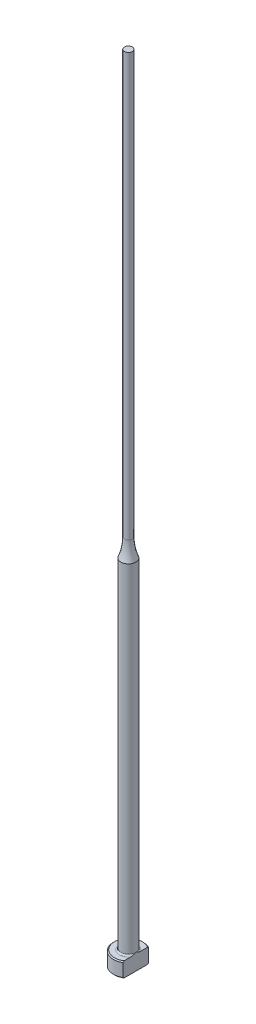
ISO-10303-21;
HEADER;
FILE_DESCRIPTION(('STEP AP214'),'2;1');
FILE_NAME('part.step','',(''),(''),'','','');
FILE_SCHEMA(('AUTOMOTIVE_DESIGN { 1 0 10303 214 1 1 1 1 }'));
ENDSEC;
DATA;
#1=APPLICATION_CONTEXT('core data for automotive mechanical design processes');
#2=APPLICATION_PROTOCOL_DEFINITION('international standard','automotive_design',2000,#1);
#3=PRODUCT_CONTEXT('',#1,'mechanical');
#4=PRODUCT('Part','Part','',(#3));
#5=PRODUCT_RELATED_PRODUCT_CATEGORY('part','',(#4));
#6=PRODUCT_DEFINITION_FORMATION('','',#4);
#7=PRODUCT_DEFINITION_CONTEXT('part definition',#1,'design');
#8=PRODUCT_DEFINITION('design','',#6,#7);
#9=PRODUCT_DEFINITION_SHAPE('','',#8);
#10=(LENGTH_UNIT() NAMED_UNIT(*) SI_UNIT(.MILLI.,.METRE.));
#11=(NAMED_UNIT(*) PLANE_ANGLE_UNIT() SI_UNIT($,.RADIAN.));
#12=(NAMED_UNIT(*) SI_UNIT($,.STERADIAN.) SOLID_ANGLE_UNIT());
#13=UNCERTAINTY_MEASURE_WITH_UNIT(LENGTH_MEASURE(1.E-05),#10,'distance_accuracy_value','');
#14=(GEOMETRIC_REPRESENTATION_CONTEXT(3) GLOBAL_UNCERTAINTY_ASSIGNED_CONTEXT((#13)) GLOBAL_UNIT_ASSIGNED_CONTEXT((#10,
#11,#12)) REPRESENTATION_CONTEXT('',''));
#15=CARTESIAN_POINT('',(0.,0.,0.));
#16=DIRECTION('',(0.,0.,1.));
#17=DIRECTION('',(1.,0.,0.));
#18=AXIS2_PLACEMENT_3D('',#15,#16,#17);
#19=CARTESIAN_POINT('',(-2.99999999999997,3.,0.));
#20=DIRECTION('',(0.,1.,0.));
#21=DIRECTION('',(0.,0.,1.));
#22=AXIS2_PLACEMENT_3D('',#19,#20,#21);
#23=PLANE('',#22);
#24=CARTESIAN_POINT('',(0.,3.,0.));
#25=DIRECTION('',(0.,1.,0.));
#26=DIRECTION('',(0.,0.,1.));
#27=AXIS2_PLACEMENT_3D('',#24,#25,#26);
#28=CIRCLE('',#27,2.79999999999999);
#29=CARTESIAN_POINT('',(1.49999999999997,3.,-2.36431808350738));
#30=VERTEX_POINT('',#29);
#31=CARTESIAN_POINT('',(1.49999999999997,3.,2.36431808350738));
#32=VERTEX_POINT('',#31);
#33=EDGE_CURVE('E187',#30,#32,#28,.T.);
#34=ORIENTED_EDGE('',*,*,#33,.T.);
#35=DIRECTION('',(0.,0.,-1.));
#36=VECTOR('',#35,1.);
#37=CARTESIAN_POINT('',(1.49999999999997,3.,0.));
#38=LINE('',#37,#36);
#39=CARTESIAN_POINT('',(1.49999999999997,3.00000000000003,0.99498743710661));
#40=VERTEX_POINT('',#39);
#41=EDGE_CURVE('E57',#32,#40,#38,.T.);
#42=ORIENTED_EDGE('',*,*,#41,.T.);
#43=CARTESIAN_POINT('',(0.,3.,0.));
#44=DIRECTION('',(0.,1.,0.));
#45=DIRECTION('',(0.,0.,1.));
#46=AXIS2_PLACEMENT_3D('',#43,#44,#45);
#47=CIRCLE('',#46,1.79999999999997);
#48=CARTESIAN_POINT('',(1.49999999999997,3.00000000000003,-0.994987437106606));
#49=VERTEX_POINT('',#48);
#50=EDGE_CURVE('E108',#40,#49,#47,.F.);
#51=ORIENTED_EDGE('',*,*,#50,.T.);
#52=EDGE_CURVE('E137',#49,#30,#38,.T.);
#53=ORIENTED_EDGE('',*,*,#52,.T.);
#54=EDGE_LOOP('',(#34,#42,#51,#53));
#55=FACE_BOUND('',#54,.T.);
#56=ADVANCED_FACE('F32',(#55),#23,.T.);
#57=CARTESIAN_POINT('',(0.,259.958771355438,0.));
#58=DIRECTION('',(0.,1.,0.));
#59=DIRECTION('',(0.,0.,1.));
#60=AXIS2_PLACEMENT_3D('',#57,#58,#59);
#61=CYLINDRICAL_SURFACE('',#60,2.99999999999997);
#62=CARTESIAN_POINT('',(0.,2.80000000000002,0.));
#63=DIRECTION('',(0.,1.,0.));
#64=DIRECTION('',(0.,0.,1.));
#65=AXIS2_PLACEMENT_3D('',#62,#63,#64);
#66=CIRCLE('',#65,2.99999999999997);
#67=CARTESIAN_POINT('',(1.49999999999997,2.80000000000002,2.5980762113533));
#68=VERTEX_POINT('',#67);
#69=CARTESIAN_POINT('',(1.49999999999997,2.80000000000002,-2.5980762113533));
#70=VERTEX_POINT('',#69);
#71=EDGE_CURVE('E105',#68,#70,#66,.F.);
#72=ORIENTED_EDGE('',*,*,#71,.T.);
#73=DIRECTION('',(0.,-1.,0.));
#74=VECTOR('',#73,1.);
#75=CARTESIAN_POINT('',(1.49999999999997,160.,-2.5980762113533));
#76=LINE('',#75,#74);
#77=CARTESIAN_POINT('',(1.49999999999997,0.200000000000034,-2.5980762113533));
#78=VERTEX_POINT('',#77);
#79=EDGE_CURVE('E193',#70,#78,#76,.T.);
#80=ORIENTED_EDGE('',*,*,#79,.T.);
#81=CARTESIAN_POINT('',(0.,0.200000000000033,0.));
#82=DIRECTION('',(0.,-1.,0.));
#83=DIRECTION('',(0.,0.,-1.));
#84=AXIS2_PLACEMENT_3D('',#81,#82,#83);
#85=CIRCLE('',#84,2.99999999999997);
#86=CARTESIAN_POINT('',(1.49999999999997,0.200000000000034,2.5980762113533));
#87=VERTEX_POINT('',#86);
#88=EDGE_CURVE('E100',#78,#87,#85,.F.);
#89=ORIENTED_EDGE('',*,*,#88,.T.);
#90=DIRECTION('',(0.,-1.,0.));
#91=VECTOR('',#90,1.);
#92=CARTESIAN_POINT('',(1.49999999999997,160.,2.5980762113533));
#93=LINE('',#92,#91);
#94=EDGE_CURVE('E93',#68,#87,#93,.T.);
#95=ORIENTED_EDGE('',*,*,#94,.F.);
#96=EDGE_LOOP('',(#72,#80,#89,#95));
#97=FACE_BOUND('',#96,.T.);
#98=ADVANCED_FACE('F158',(#97),#61,.T.);
#99=CARTESIAN_POINT('',(0.,0.,0.));
#100=DIRECTION('',(0.,-1.,0.));
#101=DIRECTION('',(0.,0.,-1.));
#102=AXIS2_PLACEMENT_3D('',#99,#100,#101);
#103=PLANE('',#102);
#104=CARTESIAN_POINT('',(0.,0.,0.));
#105=DIRECTION('',(0.,-1.,0.));
#106=DIRECTION('',(0.,0.,-1.));
#107=AXIS2_PLACEMENT_3D('',#104,#105,#106);
#108=CIRCLE('',#107,2.79999999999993);
#109=CARTESIAN_POINT('',(1.49999999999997,0.,2.36431808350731));
#110=VERTEX_POINT('',#109);
#111=CARTESIAN_POINT('',(1.49999999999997,0.,-2.36431808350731));
#112=VERTEX_POINT('',#111);
#113=EDGE_CURVE('E98',#110,#112,#108,.T.);
#114=ORIENTED_EDGE('',*,*,#113,.T.);
#115=DIRECTION('',(0.,0.,1.));
#116=VECTOR('',#115,1.);
#117=CARTESIAN_POINT('',(1.49999999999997,0.,-2.5980762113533));
#118=LINE('',#117,#116);
#119=EDGE_CURVE('E83',#112,#110,#118,.T.);
#120=ORIENTED_EDGE('',*,*,#119,.T.);
#121=EDGE_LOOP('',(#114,#120));
#122=FACE_BOUND('',#121,.T.);
#123=ADVANCED_FACE('F103',(#122),#103,.T.);
#124=CARTESIAN_POINT('',(0.,3.,0.));
#125=DIRECTION('',(0.,-1.,0.));
#126=DIRECTION('',(0.,0.,-1.));
#127=AXIS2_PLACEMENT_3D('',#124,#125,#126);
#128=CONICAL_SURFACE('',#127,2.79999999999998,0.785398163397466);
#129=ORIENTED_EDGE('',*,*,#71,.F.);
#130=CARTESIAN_POINT('',(1.49999999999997,-0.111741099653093,5.71827621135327));
#131=CARTESIAN_POINT('',(1.49999999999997,0.0136183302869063,5.58866816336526));
#132=CARTESIAN_POINT('',(1.49999999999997,0.138843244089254,5.45892957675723));
#133=CARTESIAN_POINT('',(1.49999999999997,0.388944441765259,5.19911365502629));
#134=CARTESIAN_POINT('',(1.49999999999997,0.513820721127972,5.06903631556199));
#135=CARTESIAN_POINT('',(1.49999999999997,0.763205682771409,4.80840180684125));
#136=CARTESIAN_POINT('',(1.49999999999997,0.887714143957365,4.67784442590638));
#137=CARTESIAN_POINT('',(1.49999999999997,1.13618059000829,4.41620813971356));
#138=CARTESIAN_POINT('',(1.49999999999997,1.26013857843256,4.28512923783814));
#139=CARTESIAN_POINT('',(1.49999999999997,1.50488975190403,4.02490837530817));
#140=CARTESIAN_POINT('',(1.49999999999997,1.6256969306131,3.89577958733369));
#141=CARTESIAN_POINT('',(1.49999999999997,1.86640694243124,3.63668213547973));
#142=CARTESIAN_POINT('',(1.49999999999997,1.98630978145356,3.50671347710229));
#143=CARTESIAN_POINT('',(1.49999999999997,2.22486033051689,3.24567921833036));
#144=CARTESIAN_POINT('',(1.49999999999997,2.34350830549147,3.11461386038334));
#145=CARTESIAN_POINT('',(1.49999999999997,2.57907716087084,2.85094268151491));
#146=CARTESIAN_POINT('',(1.49999999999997,2.69599811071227,2.71833692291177));
#147=CARTESIAN_POINT('',(1.49999999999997,2.88262371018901,2.50255231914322));
#148=CARTESIAN_POINT('',(1.49999999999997,2.95312454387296,2.42006293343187));
#149=CARTESIAN_POINT('',(1.49999999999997,3.0928709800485,2.25401084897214));
#150=CARTESIAN_POINT('',(1.49999999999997,3.16211645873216,2.17044804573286));
#151=CARTESIAN_POINT('',(1.49999999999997,3.29964684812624,2.00105967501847));
#152=CARTESIAN_POINT('',(1.49999999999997,3.36791386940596,1.91521952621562));
#153=CARTESIAN_POINT('',(1.49999999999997,3.50205840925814,1.74171392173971));
#154=CARTESIAN_POINT('',(1.49999999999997,3.56793649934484,1.65404891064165));
#155=CARTESIAN_POINT('',(1.49999999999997,3.69728151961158,1.47490236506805));
#156=CARTESIAN_POINT('',(1.49999999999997,3.76069661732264,1.38338308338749));
#157=CARTESIAN_POINT('',(1.49999999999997,3.8823953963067,1.19675661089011));
#158=CARTESIAN_POINT('',(1.49999999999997,3.94067201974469,1.10164473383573));
#159=CARTESIAN_POINT('',(1.49999999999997,4.04841325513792,0.908008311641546));
#160=CARTESIAN_POINT('',(1.49999999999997,4.0979780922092,0.809540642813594));
#161=CARTESIAN_POINT('',(1.49999999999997,4.18432188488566,0.607192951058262));
#162=CARTESIAN_POINT('',(1.49999999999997,4.22114374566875,0.503332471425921));
#163=CARTESIAN_POINT('',(1.49999999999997,4.26099935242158,0.347577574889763));
#164=CARTESIAN_POINT('',(1.49999999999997,4.27157029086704,0.297609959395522));
#165=CARTESIAN_POINT('',(1.49999999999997,4.28794860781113,0.196885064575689));
#166=CARTESIAN_POINT('',(1.49999999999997,4.29375640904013,0.146127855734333));
#167=CARTESIAN_POINT('',(1.49999999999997,4.30019707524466,0.0444388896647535));
#168=CARTESIAN_POINT('',(1.49999999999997,4.30084594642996,-0.00649183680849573));
#169=CARTESIAN_POINT('',(1.49999999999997,4.29696416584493,-0.108155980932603));
#170=CARTESIAN_POINT('',(1.49999999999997,4.29243308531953,-0.15888938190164));
#171=CARTESIAN_POINT('',(1.49999999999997,4.27856915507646,-0.259234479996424));
#172=CARTESIAN_POINT('',(1.49999999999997,4.26927821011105,-0.30885208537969));
#173=CARTESIAN_POINT('',(1.49999999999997,4.24647108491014,-0.407110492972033));
#174=CARTESIAN_POINT('',(1.49999999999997,4.2329532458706,-0.455750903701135));
#175=CARTESIAN_POINT('',(1.49999999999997,4.20226175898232,-0.552149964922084));
#176=CARTESIAN_POINT('',(1.49999999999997,4.18506801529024,-0.599902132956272));
#177=CARTESIAN_POINT('',(1.49999999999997,4.14771387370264,-0.694205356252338));
#178=CARTESIAN_POINT('',(1.49999999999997,4.1275540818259,-0.740756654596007));
#179=CARTESIAN_POINT('',(1.49999999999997,4.06327696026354,-0.879166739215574));
#180=CARTESIAN_POINT('',(1.49999999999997,4.01551721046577,-0.969329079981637));
#181=CARTESIAN_POINT('',(1.49999999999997,3.91367909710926,-1.1460431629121));
#182=CARTESIAN_POINT('',(1.49999999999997,3.85959300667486,-1.23259031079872));
#183=CARTESIAN_POINT('',(1.49999999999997,3.74697968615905,-1.40321348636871));
#184=CARTESIAN_POINT('',(1.49999999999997,3.68843573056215,-1.48727838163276));
#185=CARTESIAN_POINT('',(1.49999999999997,3.56843845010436,-1.65322187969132));
#186=CARTESIAN_POINT('',(1.49999999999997,3.50698656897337,-1.73510153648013));
#187=CARTESIAN_POINT('',(1.49999999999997,3.38115673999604,-1.89829823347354));
#188=CARTESIAN_POINT('',(1.49999999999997,3.31675092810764,-1.97959369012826));
#189=CARTESIAN_POINT('',(1.49999999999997,3.18634068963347,-2.14090082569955));
#190=CARTESIAN_POINT('',(1.49999999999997,3.12033609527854,-2.22091236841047));
#191=CARTESIAN_POINT('',(1.49999999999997,2.92086431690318,-2.45906508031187));
#192=CARTESIAN_POINT('',(1.49999999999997,2.78562663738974,-2.61572090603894));
#193=CARTESIAN_POINT('',(1.49999999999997,2.53554498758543,-2.90006295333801));
#194=CARTESIAN_POINT('',(1.49999999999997,2.42114543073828,-3.02814382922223));
#195=CARTESIAN_POINT('',(1.49999999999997,2.19093557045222,-3.28303767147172));
#196=CARTESIAN_POINT('',(1.49999999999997,2.07512522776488,-3.40985060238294));
#197=CARTESIAN_POINT('',(1.49999999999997,1.72597067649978,-3.7891384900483));
#198=CARTESIAN_POINT('',(1.49999999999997,1.49111760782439,-4.04022177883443));
#199=CARTESIAN_POINT('',(1.49999999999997,1.02882478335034,-4.52992803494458));
#200=CARTESIAN_POINT('',(1.49999999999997,0.801477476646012,-4.76863870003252));
#201=CARTESIAN_POINT('',(1.49999999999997,0.459548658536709,-5.12558036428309));
#202=CARTESIAN_POINT('',(1.49999999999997,0.345484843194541,-5.2443077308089));
#203=CARTESIAN_POINT('',(1.49999999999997,0.117071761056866,-5.48148573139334));
#204=CARTESIAN_POINT('',(1.49999999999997,0.00272249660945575,-5.59993636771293));
#205=CARTESIAN_POINT('',(1.49999999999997,-0.111741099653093,-5.71827621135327));
#206=B_SPLINE_CURVE_WITH_KNOTS('',3,(#130,#131,#132,#133,#134,#135,#136,#137,#138,#139,#140,
#141,#142,#143,#144,#145,#146,#147,#148,#149,#150,#151,#152,#153,#154,#155,#156,#157,#158,#159,
#160,#161,#162,#163,#164,#165,#166,#167,#168,#169,#170,#171,#172,#173,#174,#175,#176,#177,#178,
#179,#180,#181,#182,#183,#184,#185,#186,#187,#188,#189,#190,#191,#192,#193,#194,#195,#196,#197,
#198,#199,#200,#201,#202,#203,#204,#205),.UNSPECIFIED.,.F.,.F.,(4,2,2,2,2,2,2,2,2,2,2,2,2,2,2,2,
2,2,2,2,2,2,2,2,2,2,2,2,2,2,2,2,2,2,2,2,2,4),(0.,0.540943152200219,1.08189327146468,
1.62312052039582,2.16434426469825,2.69482920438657,3.22531067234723,3.75567781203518,
4.2860235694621,4.61155053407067,4.93710943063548,5.2661094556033,5.59503024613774,
5.92894782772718,6.26331713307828,6.59354403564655,6.92264800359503,7.0756747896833,
7.22868799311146,7.38122626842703,7.53377717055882,7.68500755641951,7.83629736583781,
7.98843643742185,8.14054446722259,8.44618799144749,8.75220879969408,9.05944044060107,
9.36652111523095,9.67764287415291,9.98879742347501,10.6095925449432,11.1247803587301,
11.6399825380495,12.6713544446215,13.6603005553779,14.1542238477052,14.6481430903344),.UNSPECIFIED.);
#207=EDGE_CURVE('E136',#68,#32,#206,.T.);
#208=ORIENTED_EDGE('',*,*,#207,.T.);
#209=ORIENTED_EDGE('',*,*,#33,.F.);
#210=EDGE_CURVE('E128',#30,#70,#206,.T.);
#211=ORIENTED_EDGE('',*,*,#210,.T.);
#212=EDGE_LOOP('',(#129,#208,#209,#211));
#213=FACE_BOUND('',#212,.T.);
#214=ADVANCED_FACE('F144',(#213),#128,.T.);
#215=CARTESIAN_POINT('',(0.,0.200000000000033,0.));
#216=DIRECTION('',(0.,1.,0.));
#217=DIRECTION('',(0.,0.,1.));
#218=AXIS2_PLACEMENT_3D('',#215,#216,#217);
#219=CONICAL_SURFACE('',#218,2.99999999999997,0.785398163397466);
#220=ORIENTED_EDGE('',*,*,#88,.F.);
#221=CARTESIAN_POINT('',(1.49999999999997,3.11174109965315,-5.71827621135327));
#222=CARTESIAN_POINT('',(1.49999999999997,2.98638166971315,-5.58866816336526));
#223=CARTESIAN_POINT('',(1.49999999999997,2.8611567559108,-5.45892957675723));
#224=CARTESIAN_POINT('',(1.49999999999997,2.6110555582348,-5.19911365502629));
#225=CARTESIAN_POINT('',(1.49999999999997,2.48617927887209,-5.06903631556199));
#226=CARTESIAN_POINT('',(1.49999999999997,2.23679431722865,-4.80840180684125));
#227=CARTESIAN_POINT('',(1.49999999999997,2.11228585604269,-4.67784442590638));
#228=CARTESIAN_POINT('',(1.49999999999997,1.86381940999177,-4.41620813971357));
#229=CARTESIAN_POINT('',(1.49999999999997,1.7398614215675,-4.28512923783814));
#230=CARTESIAN_POINT('',(1.49999999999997,1.49511024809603,-4.02490837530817));
#231=CARTESIAN_POINT('',(1.49999999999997,1.37430306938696,-3.89577958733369));
#232=CARTESIAN_POINT('',(1.49999999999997,1.13359305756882,-3.63668213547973));
#233=CARTESIAN_POINT('',(1.49999999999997,1.0136902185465,-3.50671347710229));
#234=CARTESIAN_POINT('',(1.49999999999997,0.775139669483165,-3.24567921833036));
#235=CARTESIAN_POINT('',(1.49999999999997,0.656491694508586,-3.11461386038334));
#236=CARTESIAN_POINT('',(1.49999999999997,0.420922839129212,-2.85094268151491));
#237=CARTESIAN_POINT('',(1.49999999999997,0.304001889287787,-2.71833692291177));
#238=CARTESIAN_POINT('',(1.49999999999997,0.117376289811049,-2.50255231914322));
#239=CARTESIAN_POINT('',(1.49999999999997,0.0468754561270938,-2.42006293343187));
#240=CARTESIAN_POINT('',(1.49999999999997,-0.0928709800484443,-2.25401084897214));
#241=CARTESIAN_POINT('',(1.49999999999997,-0.162116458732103,-2.17044804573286));
#242=CARTESIAN_POINT('',(1.49999999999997,-0.299646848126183,-2.00105967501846));
#243=CARTESIAN_POINT('',(1.49999999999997,-0.367913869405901,-1.91521952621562));
#244=CARTESIAN_POINT('',(1.49999999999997,-0.502058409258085,-1.74171392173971));
#245=CARTESIAN_POINT('',(1.49999999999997,-0.567936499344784,-1.65404891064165));
#246=CARTESIAN_POINT('',(1.49999999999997,-0.697281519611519,-1.47490236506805));
#247=CARTESIAN_POINT('',(1.49999999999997,-0.760696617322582,-1.38338308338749));
#248=CARTESIAN_POINT('',(1.49999999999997,-0.882395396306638,-1.19675661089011));
#249=CARTESIAN_POINT('',(1.49999999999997,-0.940672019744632,-1.10164473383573));
#250=CARTESIAN_POINT('',(1.49999999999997,-1.04841325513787,-0.908008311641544));
#251=CARTESIAN_POINT('',(1.49999999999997,-1.09797809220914,-0.809540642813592));
#252=CARTESIAN_POINT('',(1.49999999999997,-1.1843218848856,-0.60719295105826));
#253=CARTESIAN_POINT('',(1.49999999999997,-1.22114374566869,-0.503332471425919));
#254=CARTESIAN_POINT('',(1.49999999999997,-1.26099935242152,-0.347577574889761));
#255=CARTESIAN_POINT('',(1.49999999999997,-1.27157029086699,-0.29760995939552));
#256=CARTESIAN_POINT('',(1.49999999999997,-1.28794860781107,-0.196885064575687));
#257=CARTESIAN_POINT('',(1.49999999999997,-1.29375640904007,-0.146127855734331));
#258=CARTESIAN_POINT('',(1.49999999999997,-1.30019707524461,-0.0444388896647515));
#259=CARTESIAN_POINT('',(1.49999999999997,-1.3008459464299,0.00649183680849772));
#260=CARTESIAN_POINT('',(1.49999999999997,-1.29696416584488,0.108155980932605));
#261=CARTESIAN_POINT('',(1.49999999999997,-1.29243308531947,0.158889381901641));
#262=CARTESIAN_POINT('',(1.49999999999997,-1.2785691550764,0.259234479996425));
#263=CARTESIAN_POINT('',(1.49999999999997,-1.26927821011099,0.308852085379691));
#264=CARTESIAN_POINT('',(1.49999999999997,-1.24647108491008,0.407110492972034));
#265=CARTESIAN_POINT('',(1.49999999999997,-1.23295324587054,0.455750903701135));
#266=CARTESIAN_POINT('',(1.49999999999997,-1.20226175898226,0.552149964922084));
#267=CARTESIAN_POINT('',(1.49999999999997,-1.18506801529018,0.599902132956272));
#268=CARTESIAN_POINT('',(1.49999999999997,-1.14771387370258,0.694205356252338));
#269=CARTESIAN_POINT('',(1.49999999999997,-1.12755408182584,0.740756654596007));
#270=CARTESIAN_POINT('',(1.49999999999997,-1.06327696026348,0.879166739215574));
#271=CARTESIAN_POINT('',(1.49999999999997,-1.01551721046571,0.969329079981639));
#272=CARTESIAN_POINT('',(1.49999999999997,-0.913679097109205,1.1460431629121));
#273=CARTESIAN_POINT('',(1.49999999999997,-0.8595930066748,1.23259031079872));
#274=CARTESIAN_POINT('',(1.49999999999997,-0.746979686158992,1.40321348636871));
#275=CARTESIAN_POINT('',(1.49999999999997,-0.688435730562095,1.48727838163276));
#276=CARTESIAN_POINT('',(1.49999999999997,-0.568438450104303,1.65322187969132));
#277=CARTESIAN_POINT('',(1.49999999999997,-0.506986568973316,1.73510153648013));
#278=CARTESIAN_POINT('',(1.49999999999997,-0.381156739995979,1.89829823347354));
#279=CARTESIAN_POINT('',(1.49999999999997,-0.316750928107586,1.97959369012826));
#280=CARTESIAN_POINT('',(1.49999999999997,-0.186340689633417,2.14090082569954));
#281=CARTESIAN_POINT('',(1.49999999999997,-0.120336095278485,2.22091236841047));
#282=CARTESIAN_POINT('',(1.49999999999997,0.0791356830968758,2.45906508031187));
#283=CARTESIAN_POINT('',(1.49999999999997,0.214373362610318,2.61572090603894));
#284=CARTESIAN_POINT('',(1.49999999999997,0.46445501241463,2.90006295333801));
#285=CARTESIAN_POINT('',(1.49999999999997,0.578854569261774,3.02814382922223));
#286=CARTESIAN_POINT('',(1.49999999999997,0.809064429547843,3.28303767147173));
#287=CARTESIAN_POINT('',(1.49999999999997,0.924874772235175,3.40985060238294));
#288=CARTESIAN_POINT('',(1.49999999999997,1.27402932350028,3.78913849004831));
#289=CARTESIAN_POINT('',(1.49999999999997,1.50888239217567,4.04022177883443));
#290=CARTESIAN_POINT('',(1.49999999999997,1.97117521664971,4.52992803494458));
#291=CARTESIAN_POINT('',(1.49999999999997,2.19852252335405,4.76863870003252));
#292=CARTESIAN_POINT('',(1.49999999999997,2.54045134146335,5.12558036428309));
#293=CARTESIAN_POINT('',(1.49999999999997,2.65451515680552,5.2443077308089));
#294=CARTESIAN_POINT('',(1.49999999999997,2.88292823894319,5.48148573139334));
#295=CARTESIAN_POINT('',(1.49999999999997,2.9972775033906,5.59993636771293));
#296=CARTESIAN_POINT('',(1.49999999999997,3.11174109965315,5.71827621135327));
#297=B_SPLINE_CURVE_WITH_KNOTS('',3,(#221,#222,#223,#224,#225,#226,#227,#228,#229,#230,#231,
#232,#233,#234,#235,#236,#237,#238,#239,#240,#241,#242,#243,#244,#245,#246,#247,#248,#249,#250,
#251,#252,#253,#254,#255,#256,#257,#258,#259,#260,#261,#262,#263,#264,#265,#266,#267,#268,#269,
#270,#271,#272,#273,#274,#275,#276,#277,#278,#279,#280,#281,#282,#283,#284,#285,#286,#287,#288,
#289,#290,#291,#292,#293,#294,#295,#296),.UNSPECIFIED.,.F.,.F.,(4,2,2,2,2,2,2,2,2,2,2,2,2,2,2,2,
2,2,2,2,2,2,2,2,2,2,2,2,2,2,2,2,2,2,2,2,2,4),(0.,0.540943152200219,1.08189327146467,
1.62312052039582,2.16434426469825,2.69482920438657,3.22531067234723,3.75567781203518,
4.28602356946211,4.61155053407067,4.93710943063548,5.2661094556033,5.59503024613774,
5.92894782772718,6.26331713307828,6.59354403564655,6.92264800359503,7.0756747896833,
7.22868799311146,7.38122626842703,7.53377717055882,7.68500755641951,7.83629736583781,
7.98843643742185,8.14054446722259,8.4461879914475,8.75220879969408,9.05944044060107,
9.36652111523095,9.6776428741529,9.98879742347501,10.6095925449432,11.1247803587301,
11.6399825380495,12.6713544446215,13.6603005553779,14.1542238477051,14.6481430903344),.UNSPECIFIED.);
#298=EDGE_CURVE('E86',#78,#112,#297,.T.);
#299=ORIENTED_EDGE('',*,*,#298,.T.);
#300=ORIENTED_EDGE('',*,*,#113,.F.);
#301=EDGE_CURVE('E89',#110,#87,#297,.T.);
#302=ORIENTED_EDGE('',*,*,#301,.T.);
#303=EDGE_LOOP('',(#220,#299,#300,#302));
#304=FACE_BOUND('',#303,.T.);
#305=ADVANCED_FACE('F97',(#304),#219,.T.);
#306=CARTESIAN_POINT('',(0.,3.30000000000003,0.));
#307=DIRECTION('',(0.,1.,0.));
#308=DIRECTION('',(0.,0.,1.));
#309=AXIS2_PLACEMENT_3D('',#306,#307,#308);
#310=TOROIDAL_SURFACE('',#309,1.79999999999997,0.3);
#311=CARTESIAN_POINT('',(1.49999999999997,3.30000000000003,0.));
#312=CARTESIAN_POINT('',(1.49999999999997,3.300000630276,3.41555678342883E-12));
#313=CARTESIAN_POINT('',(1.49999999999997,3.30000126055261,-1.15373640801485E-07));
#314=CARTESIAN_POINT('',(1.49999999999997,3.3000024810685,-4.90631575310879E-07));
#315=CARTESIAN_POINT('',(1.49999999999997,3.30000307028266,-7.53296670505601E-07));
#316=CARTESIAN_POINT('',(1.49999999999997,3.30000424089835,-1.38757096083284E-06));
#317=CARTESIAN_POINT('',(1.49999999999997,3.300004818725,-1.76563001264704E-06));
#318=CARTESIAN_POINT('',(1.49999999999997,3.30000591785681,-2.58768006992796E-06));
#319=CARTESIAN_POINT('',(1.49999999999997,3.30000643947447,-3.03127014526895E-06));
#320=CARTESIAN_POINT('',(1.49999999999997,3.30000815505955,-4.60021967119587E-06));
#321=CARTESIAN_POINT('',(1.49999999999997,3.30000927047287,-5.8124152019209E-06));
#322=CARTESIAN_POINT('',(1.49999999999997,3.30001128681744,-8.33989413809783E-06));
#323=CARTESIAN_POINT('',(1.49999999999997,3.30001219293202,-9.65128157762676E-06));
#324=CARTESIAN_POINT('',(1.49999999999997,3.30001551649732,-1.46782505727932E-05));
#325=CARTESIAN_POINT('',(1.49999999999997,3.30001775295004,-1.8517976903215E-05));
#326=CARTESIAN_POINT('',(1.49999999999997,3.30002148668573,-2.61616194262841E-05));
#327=CARTESIAN_POINT('',(1.49999999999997,3.30002302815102,-2.99447742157E-05));
#328=CARTESIAN_POINT('',(1.49999999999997,3.30002943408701,-4.58003743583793E-05));
#329=CARTESIAN_POINT('',(1.49999999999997,3.3000341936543,-5.79079078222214E-05));
#330=CARTESIAN_POINT('',(1.49999999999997,3.30004197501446,-8.07263755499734E-05));
#331=CARTESIAN_POINT('',(1.49999999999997,3.30004514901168,-9.13834709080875E-05));
#332=CARTESIAN_POINT('',(1.49999999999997,3.30006989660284,-0.000167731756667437));
#333=CARTESIAN_POINT('',(1.49999999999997,3.30010092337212,-0.000229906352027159));
#334=CARTESIAN_POINT('',(1.49999999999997,3.30021632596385,-0.000470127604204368));
#335=CARTESIAN_POINT('',(1.49999999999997,3.30029368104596,-0.000650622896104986));
#336=CARTESIAN_POINT('',(1.49999999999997,3.30059619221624,-0.00134589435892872));
#337=CARTESIAN_POINT('',(1.49999999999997,3.30082870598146,-0.00185814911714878));
#338=CARTESIAN_POINT('',(1.49999999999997,3.30176696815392,-0.00393547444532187));
#339=CARTESIAN_POINT('',(1.49999999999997,3.30246445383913,-0.00550332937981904));
#340=CARTESIAN_POINT('',(1.49999999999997,3.31426785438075,-0.0320229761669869));
#341=CARTESIAN_POINT('',(1.49999999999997,3.32544800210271,-0.0569503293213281));
#342=CARTESIAN_POINT('',(1.49999999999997,3.34725700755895,-0.105984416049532));
#343=CARTESIAN_POINT('',(1.49999999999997,3.35789134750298,-0.130088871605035));
#344=CARTESIAN_POINT('',(1.49999999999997,3.38015321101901,-0.181096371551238));
#345=CARTESIAN_POINT('',(1.49999999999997,3.39175804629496,-0.208009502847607));
#346=CARTESIAN_POINT('',(1.49999999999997,3.41469034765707,-0.262264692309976));
#347=CARTESIAN_POINT('',(1.49999999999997,3.42601398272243,-0.289608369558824));
#348=CARTESIAN_POINT('',(1.49999999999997,3.45363212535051,-0.35820378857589));
#349=CARTESIAN_POINT('',(1.49999999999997,3.46959026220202,-0.39959288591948));
#350=CARTESIAN_POINT('',(1.49999999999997,3.49940505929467,-0.482097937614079));
#351=CARTESIAN_POINT('',(1.49999999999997,3.51330033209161,-0.523199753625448));
#352=CARTESIAN_POINT('',(1.49999999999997,3.53552507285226,-0.595497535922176));
#353=CARTESIAN_POINT('',(1.49999999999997,3.54436834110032,-0.626532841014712));
#354=CARTESIAN_POINT('',(1.49999999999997,3.56052427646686,-0.6891760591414));
#355=CARTESIAN_POINT('',(1.49999999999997,3.5678279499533,-0.720786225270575));
#356=CARTESIAN_POINT('',(1.49999999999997,3.5875075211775,-0.819524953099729));
#357=CARTESIAN_POINT('',(1.49999999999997,3.59661044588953,-0.88742909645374));
#358=CARTESIAN_POINT('',(1.49999999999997,3.60059842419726,-0.991180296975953));
#359=CARTESIAN_POINT('',(1.49999999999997,3.60019840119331,-1.02684364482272));
#360=CARTESIAN_POINT('',(1.49999999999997,3.59497085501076,-1.097505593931));
#361=CARTESIAN_POINT('',(1.49999999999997,3.59019295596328,-1.13250716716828));
#362=CARTESIAN_POINT('',(1.49999999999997,3.57687734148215,-1.19353096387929));
#363=CARTESIAN_POINT('',(1.49999999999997,3.56943875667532,-1.21978854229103));
#364=CARTESIAN_POINT('',(1.49999999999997,3.55063748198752,-1.27094658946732));
#365=CARTESIAN_POINT('',(1.49999999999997,3.53927342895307,-1.29584658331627));
#366=CARTESIAN_POINT('',(1.49999999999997,3.51660016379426,-1.33501873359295));
#367=CARTESIAN_POINT('',(1.49999999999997,3.50657738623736,-1.35003296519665));
#368=CARTESIAN_POINT('',(1.49999999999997,3.48437469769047,-1.37837252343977));
#369=CARTESIAN_POINT('',(1.49999999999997,3.47219867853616,-1.39170082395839));
#370=CARTESIAN_POINT('',(1.49999999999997,3.44835614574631,-1.41349417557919));
#371=CARTESIAN_POINT('',(1.49999999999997,3.43709185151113,-1.42239673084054));
#372=CARTESIAN_POINT('',(1.49999999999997,3.41325256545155,-1.43825467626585));
#373=CARTESIAN_POINT('',(1.49999999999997,3.40067804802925,-1.44521076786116));
#374=CARTESIAN_POINT('',(1.49999999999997,3.37433767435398,-1.45677158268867));
#375=CARTESIAN_POINT('',(1.49999999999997,3.36056203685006,-1.46135438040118));
#376=CARTESIAN_POINT('',(1.49999999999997,3.33237324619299,-1.46767730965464));
#377=CARTESIAN_POINT('',(1.49999999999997,3.31796076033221,-1.46942034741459));
#378=CARTESIAN_POINT('',(1.49999999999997,3.29122479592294,-1.4698720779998));
#379=CARTESIAN_POINT('',(1.49999999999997,3.27890664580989,-1.468990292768));
#380=CARTESIAN_POINT('',(1.49999999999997,3.25461019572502,-1.4651157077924));
#381=CARTESIAN_POINT('',(1.49999999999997,3.2426318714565,-1.46212305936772));
#382=CARTESIAN_POINT('',(1.49999999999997,3.21959683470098,-1.4543117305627));
#383=CARTESIAN_POINT('',(1.49999999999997,3.20852542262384,-1.44953579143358));
#384=CARTESIAN_POINT('',(1.49999999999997,3.18721125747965,-1.43840957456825));
#385=CARTESIAN_POINT('',(1.49999999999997,3.1769687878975,-1.43205876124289));
#386=CARTESIAN_POINT('',(1.49999999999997,3.15325976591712,-1.41506353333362));
#387=CARTESIAN_POINT('',(1.49999999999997,3.14027750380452,-1.40374235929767));
#388=CARTESIAN_POINT('',(1.49999999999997,3.11630720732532,-1.37914825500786));
#389=CARTESIAN_POINT('',(1.49999999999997,3.10532420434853,-1.36587054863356));
#390=CARTESIAN_POINT('',(1.49999999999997,3.08100891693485,-1.33197272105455));
#391=CARTESIAN_POINT('',(1.49999999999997,3.06867625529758,-1.31063843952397));
#392=CARTESIAN_POINT('',(1.49999999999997,3.04751867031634,-1.26637455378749));
#393=CARTESIAN_POINT('',(1.49999999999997,3.03869240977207,-1.24344556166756));
#394=CARTESIAN_POINT('',(1.49999999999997,3.01978360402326,-1.18316534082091));
#395=CARTESIAN_POINT('',(1.49999999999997,3.01191472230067,-1.14512623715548));
#396=CARTESIAN_POINT('',(1.49999999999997,3.00188285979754,-1.06789971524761));
#397=CARTESIAN_POINT('',(1.49999999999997,2.99979735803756,-1.02870374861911));
#398=CARTESIAN_POINT('',(1.49999999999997,3.00021727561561,-0.953160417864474));
#399=CARTESIAN_POINT('',(1.49999999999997,3.00240673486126,-0.916808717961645));
#400=CARTESIAN_POINT('',(1.49999999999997,3.0099643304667,-0.844432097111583));
#401=CARTESIAN_POINT('',(1.49999999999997,3.01533462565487,-0.808407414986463));
#402=CARTESIAN_POINT('',(1.49999999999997,3.02828086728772,-0.738670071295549));
#403=CARTESIAN_POINT('',(1.49999999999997,3.03573028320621,-0.704933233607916));
#404=CARTESIAN_POINT('',(1.49999999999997,3.05243174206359,-0.638128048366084));
#405=CARTESIAN_POINT('',(1.49999999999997,3.06167285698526,-0.605056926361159));
#406=CARTESIAN_POINT('',(1.49999999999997,3.08440652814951,-0.53019513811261));
#407=CARTESIAN_POINT('',(1.49999999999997,3.09836576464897,-0.488547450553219));
#408=CARTESIAN_POINT('',(1.49999999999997,3.1283820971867,-0.404954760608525));
#409=CARTESIAN_POINT('',(1.49999999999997,3.14447968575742,-0.363024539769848));
#410=CARTESIAN_POINT('',(1.49999999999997,3.17238454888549,-0.293508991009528));
#411=CARTESIAN_POINT('',(1.49999999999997,3.18384249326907,-0.265781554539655));
#412=CARTESIAN_POINT('',(1.49999999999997,3.20705854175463,-0.210769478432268));
#413=CARTESIAN_POINT('',(1.49999999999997,3.21881265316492,-0.183483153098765));
#414=CARTESIAN_POINT('',(1.49999999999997,3.24136702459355,-0.131772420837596));
#415=CARTESIAN_POINT('',(1.49999999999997,3.25214361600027,-0.107337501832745));
#416=CARTESIAN_POINT('',(1.49999999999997,3.27424746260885,-0.0576321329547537));
#417=CARTESIAN_POINT('',(1.49999999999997,3.28558038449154,-0.0323640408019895));
#418=CARTESIAN_POINT('',(1.49999999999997,3.29753556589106,-0.00550327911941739));
#419=CARTESIAN_POINT('',(1.49999999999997,3.29823307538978,-0.00393537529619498));
#420=CARTESIAN_POINT('',(1.49999999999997,3.29917134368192,-0.00185803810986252));
#421=CARTESIAN_POINT('',(1.49999999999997,3.29940384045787,-0.00134582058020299));
#422=CARTESIAN_POINT('',(1.49999999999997,3.29970633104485,-0.000650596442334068));
#423=CARTESIAN_POINT('',(1.49999999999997,3.29978368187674,-0.000470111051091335));
#424=CARTESIAN_POINT('',(1.49999999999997,3.29989907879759,-0.000229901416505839));
#425=CARTESIAN_POINT('',(1.49999999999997,3.29993010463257,-0.000167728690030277));
#426=CARTESIAN_POINT('',(1.49999999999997,3.29995485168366,-9.13825689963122E-05));
#427=CARTESIAN_POINT('',(1.49999999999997,3.29995802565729,-8.07256241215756E-05));
#428=CARTESIAN_POINT('',(1.49999999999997,3.29996580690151,-5.79074820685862E-05));
#429=CARTESIAN_POINT('',(1.49999999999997,3.29997056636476,-4.5800119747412E-05));
#430=CARTESIAN_POINT('',(1.49999999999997,3.29997697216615,-2.99447119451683E-05));
#431=CARTESIAN_POINT('',(1.49999999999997,3.2999785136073,-2.61615817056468E-05));
#432=CARTESIAN_POINT('',(1.49999999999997,3.2999822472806,-1.85179845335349E-05));
#433=CARTESIAN_POINT('',(1.49999999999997,3.29998448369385,-1.46782782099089E-05));
#434=CARTESIAN_POINT('',(1.49999999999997,3.2999878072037,-9.65132752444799E-06));
#435=CARTESIAN_POINT('',(1.49999999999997,3.299988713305,-8.33994202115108E-06));
#436=CARTESIAN_POINT('',(1.49999999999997,3.29999072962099,-5.81246426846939E-06));
#437=CARTESIAN_POINT('',(1.49999999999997,3.29999184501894,-4.600267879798E-06));
#438=CARTESIAN_POINT('',(1.49999999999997,3.29999356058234,-3.03131394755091E-06));
#439=CARTESIAN_POINT('',(1.49999999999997,3.29999408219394,-2.58772196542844E-06));
#440=CARTESIAN_POINT('',(1.49999999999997,3.2999951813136,-1.76566701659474E-06));
#441=CARTESIAN_POINT('',(1.49999999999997,3.29999575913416,-1.38760497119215E-06));
#442=CARTESIAN_POINT('',(1.49999999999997,3.29999692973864,-7.53323425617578E-07));
#443=CARTESIAN_POINT('',(1.49999999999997,3.29999751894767,-4.90654189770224E-07));
#444=CARTESIAN_POINT('',(1.49999999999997,3.29999873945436,-1.15386267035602E-07));
#445=CARTESIAN_POINT('',(1.49999999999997,3.29999936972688,-3.41554144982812E-12));
#446=CARTESIAN_POINT('',(1.49999999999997,3.30000000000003,0.));
#447=B_SPLINE_CURVE_WITH_KNOTS('',3,(#311,#312,#313,#314,#315,#316,#317,#318,#319,#320,#321,
#322,#323,#324,#325,#326,#327,#328,#329,#330,#331,#332,#333,#334,#335,#336,#337,#338,#339,#340,
#341,#342,#343,#344,#345,#346,#347,#348,#349,#350,#351,#352,#353,#354,#355,#356,#357,#358,#359,
#360,#361,#362,#363,#364,#365,#366,#367,#368,#369,#370,#371,#372,#373,#374,#375,#376,#377,#378,
#379,#380,#381,#382,#383,#384,#385,#386,#387,#388,#389,#390,#391,#392,#393,#394,#395,#396,#397,
#398,#399,#400,#401,#402,#403,#404,#405,#406,#407,#408,#409,#410,#411,#412,#413,#414,#415,#416,
#417,#418,#419,#420,#421,#422,#423,#424,#425,#426,#427,#428,#429,#430,#431,#432,#433,#434,#435,
#436,#437,#438,#439,#440,#441,#442,#443,#444,#445,#446),.UNSPECIFIED.,.T.,.F.,(4,2,2,2,2,2,2,2,
2,2,2,2,2,2,2,2,2,2,2,2,2,2,2,2,2,2,2,2,2,2,2,2,2,2,2,2,2,2,2,2,2,2,2,2,2,2,2,2,2,2,2,2,2,2,2,2,
2,2,2,2,2,2,2,2,2,2,2,4),(0.,1.88906036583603E-06,3.8150959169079E-06,5.87892837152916E-06,
7.93062024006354E-06,1.28480890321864E-05,1.76261717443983E-05,3.0909918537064E-05,
4.31529750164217E-05,8.21699329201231E-05,0.000115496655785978,0.000323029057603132,
0.000912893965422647,0.00259963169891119,0.00774858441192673,0.0896975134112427,
0.168737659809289,0.256660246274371,0.345444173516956,0.478492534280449,0.608603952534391,
0.705372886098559,0.802692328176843,1.00719557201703,1.11399616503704,1.21960092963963,
1.30124317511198,1.38291380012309,1.43690814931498,1.49080588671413,1.53371524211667,
1.57660911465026,1.61989249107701,1.66313154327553,1.69999492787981,1.73685567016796,
1.77288440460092,1.80892540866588,1.86031324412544,1.91182866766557,1.98534297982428,
2.05882922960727,2.1747172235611,2.29215041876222,2.40123170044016,2.51038710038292,
2.613972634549,2.71694519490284,2.84866234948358,2.98337525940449,3.07337666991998,
3.16250453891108,3.24262397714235,3.32569301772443,3.3308421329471,3.33252874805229,
3.33311858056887,3.33332610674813,3.33335943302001,3.33339844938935,3.3334106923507,
3.33342397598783,3.33342875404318,3.33343367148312,3.33343572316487,3.33343778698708,
3.33343971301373,3.33344160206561),.UNSPECIFIED.);
#448=CARTESIAN_POINT('',(1.49999999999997,3.30000000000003,0.));
#449=VERTEX_POINT('',#448);
#450=EDGE_CURVE('E11',#49,#449,#447,.T.);
#451=ORIENTED_EDGE('',*,*,#450,.F.);
#452=ORIENTED_EDGE('',*,*,#50,.F.);
#453=CARTESIAN_POINT('',(1.49999999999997,3.30000000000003,0.));
#454=CARTESIAN_POINT('',(1.49999999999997,3.29999936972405,-3.41547770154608E-12));
#455=CARTESIAN_POINT('',(1.49999999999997,3.29999873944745,1.15373640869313E-07));
#456=CARTESIAN_POINT('',(1.49999999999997,3.29999751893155,4.90631575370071E-07));
#457=CARTESIAN_POINT('',(1.49999999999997,3.29999692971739,7.53296670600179E-07));
#458=CARTESIAN_POINT('',(1.49999999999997,3.2999957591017,1.38757096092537E-06));
#459=CARTESIAN_POINT('',(1.49999999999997,3.29999518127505,1.76563001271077E-06));
#460=CARTESIAN_POINT('',(1.49999999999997,3.29999408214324,2.58768007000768E-06));
#461=CARTESIAN_POINT('',(1.49999999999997,3.29999356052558,3.03127014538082E-06));
#462=CARTESIAN_POINT('',(1.49999999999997,3.2999918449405,4.60021967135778E-06));
#463=CARTESIAN_POINT('',(1.49999999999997,3.29999072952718,5.81241520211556E-06));
#464=CARTESIAN_POINT('',(1.49999999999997,3.29998871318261,8.33989413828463E-06));
#465=CARTESIAN_POINT('',(1.49999999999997,3.29998780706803,9.65128157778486E-06));
#466=CARTESIAN_POINT('',(1.49999999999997,3.29998448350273,1.46782505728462E-05));
#467=CARTESIAN_POINT('',(1.49999999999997,3.29998224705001,1.85179769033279E-05));
#468=CARTESIAN_POINT('',(1.49999999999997,3.29997851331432,2.61616194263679E-05));
#469=CARTESIAN_POINT('',(1.49999999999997,3.29997697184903,2.99447742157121E-05));
#470=CARTESIAN_POINT('',(1.49999999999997,3.29997056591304,4.58003743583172E-05));
#471=CARTESIAN_POINT('',(1.49999999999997,3.29996580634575,5.79079078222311E-05));
#472=CARTESIAN_POINT('',(1.49999999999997,3.29995802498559,8.07263755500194E-05));
#473=CARTESIAN_POINT('',(1.49999999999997,3.29995485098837,9.1383470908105E-05));
#474=CARTESIAN_POINT('',(1.49999999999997,3.29993010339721,0.000167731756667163));
#475=CARTESIAN_POINT('',(1.49999999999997,3.29989907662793,0.000229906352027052));
#476=CARTESIAN_POINT('',(1.49999999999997,3.2997836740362,0.000470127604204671));
#477=CARTESIAN_POINT('',(1.49999999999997,3.2997063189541,0.000650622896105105));
#478=CARTESIAN_POINT('',(1.49999999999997,3.29940380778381,0.00134589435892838));
#479=CARTESIAN_POINT('',(1.49999999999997,3.29917129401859,0.00185814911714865));
#480=CARTESIAN_POINT('',(1.49999999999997,3.29823303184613,0.00393547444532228));
#481=CARTESIAN_POINT('',(1.49999999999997,3.29753554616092,0.00550332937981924));
#482=CARTESIAN_POINT('',(1.49999999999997,3.2857321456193,0.0320229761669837));
#483=CARTESIAN_POINT('',(1.49999999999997,3.27455199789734,0.0569503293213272));
#484=CARTESIAN_POINT('',(1.49999999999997,3.2527429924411,0.105984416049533));
#485=CARTESIAN_POINT('',(1.49999999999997,3.24210865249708,0.130088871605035));
#486=CARTESIAN_POINT('',(1.49999999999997,3.21984678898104,0.181096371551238));
#487=CARTESIAN_POINT('',(1.49999999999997,3.20824195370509,0.208009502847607));
#488=CARTESIAN_POINT('',(1.49999999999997,3.18530965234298,0.262264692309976));
#489=CARTESIAN_POINT('',(1.49999999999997,3.17398601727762,0.289608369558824));
#490=CARTESIAN_POINT('',(1.49999999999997,3.14636787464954,0.35820378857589));
#491=CARTESIAN_POINT('',(1.49999999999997,3.13040973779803,0.39959288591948));
#492=CARTESIAN_POINT('',(1.49999999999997,3.10059494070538,0.482097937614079));
#493=CARTESIAN_POINT('',(1.49999999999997,3.08669966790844,0.523199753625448));
#494=CARTESIAN_POINT('',(1.49999999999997,3.06447492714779,0.595497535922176));
#495=CARTESIAN_POINT('',(1.49999999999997,3.05563165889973,0.626532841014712));
#496=CARTESIAN_POINT('',(1.49999999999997,3.03947572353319,0.6891760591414));
#497=CARTESIAN_POINT('',(1.49999999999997,3.03217205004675,0.720786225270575));
#498=CARTESIAN_POINT('',(1.49999999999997,3.01249247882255,0.819524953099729));
#499=CARTESIAN_POINT('',(1.49999999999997,3.00338955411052,0.88742909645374));
#500=CARTESIAN_POINT('',(1.49999999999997,2.99940157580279,0.991180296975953));
#501=CARTESIAN_POINT('',(1.49999999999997,2.99980159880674,1.02684364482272));
#502=CARTESIAN_POINT('',(1.49999999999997,3.00502914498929,1.097505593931));
#503=CARTESIAN_POINT('',(1.49999999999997,3.00980704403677,1.13250716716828));
#504=CARTESIAN_POINT('',(1.49999999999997,3.0231226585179,1.19353096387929));
#505=CARTESIAN_POINT('',(1.49999999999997,3.03056124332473,1.21978854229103));
#506=CARTESIAN_POINT('',(1.49999999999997,3.04936251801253,1.27094658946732));
#507=CARTESIAN_POINT('',(1.49999999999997,3.06072657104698,1.29584658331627));
#508=CARTESIAN_POINT('',(1.49999999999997,3.08339983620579,1.33501873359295));
#509=CARTESIAN_POINT('',(1.49999999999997,3.09342261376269,1.35003296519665));
#510=CARTESIAN_POINT('',(1.49999999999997,3.11562530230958,1.37837252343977));
#511=CARTESIAN_POINT('',(1.49999999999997,3.12780132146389,1.39170082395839));
#512=CARTESIAN_POINT('',(1.49999999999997,3.15164385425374,1.41349417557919));
#513=CARTESIAN_POINT('',(1.49999999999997,3.16290814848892,1.42239673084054));
#514=CARTESIAN_POINT('',(1.49999999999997,3.1867474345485,1.43825467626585));
#515=CARTESIAN_POINT('',(1.49999999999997,3.1993219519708,1.44521076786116));
#516=CARTESIAN_POINT('',(1.49999999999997,3.22566232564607,1.45677158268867));
#517=CARTESIAN_POINT('',(1.49999999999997,3.23943796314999,1.46135438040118));
#518=CARTESIAN_POINT('',(1.49999999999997,3.26762675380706,1.46767730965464));
#519=CARTESIAN_POINT('',(1.49999999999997,3.28203923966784,1.46942034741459));
#520=CARTESIAN_POINT('',(1.49999999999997,3.30877520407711,1.4698720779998));
#521=CARTESIAN_POINT('',(1.49999999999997,3.32109335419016,1.468990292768));
#522=CARTESIAN_POINT('',(1.49999999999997,3.34538980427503,1.4651157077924));
#523=CARTESIAN_POINT('',(1.49999999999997,3.35736812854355,1.46212305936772));
#524=CARTESIAN_POINT('',(1.49999999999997,3.38040316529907,1.4543117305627));
#525=CARTESIAN_POINT('',(1.49999999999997,3.39147457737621,1.44953579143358));
#526=CARTESIAN_POINT('',(1.49999999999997,3.4127887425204,1.43840957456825));
#527=CARTESIAN_POINT('',(1.49999999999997,3.42303121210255,1.43205876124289));
#528=CARTESIAN_POINT('',(1.49999999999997,3.44674023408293,1.41506353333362));
#529=CARTESIAN_POINT('',(1.49999999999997,3.45972249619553,1.40374235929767));
#530=CARTESIAN_POINT('',(1.49999999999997,3.48369279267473,1.37914825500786));
#531=CARTESIAN_POINT('',(1.49999999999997,3.49467579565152,1.36587054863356));
#532=CARTESIAN_POINT('',(1.49999999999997,3.5189910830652,1.33197272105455));
#533=CARTESIAN_POINT('',(1.49999999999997,3.53132374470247,1.31063843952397));
#534=CARTESIAN_POINT('',(1.49999999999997,3.55248132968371,1.26637455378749));
#535=CARTESIAN_POINT('',(1.49999999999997,3.56130759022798,1.24344556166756));
#536=CARTESIAN_POINT('',(1.49999999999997,3.58021639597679,1.18316534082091));
#537=CARTESIAN_POINT('',(1.49999999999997,3.58808527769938,1.14512623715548));
#538=CARTESIAN_POINT('',(1.49999999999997,3.59811714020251,1.06789971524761));
#539=CARTESIAN_POINT('',(1.49999999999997,3.60020264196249,1.02870374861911));
#540=CARTESIAN_POINT('',(1.49999999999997,3.59978272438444,0.953160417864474));
#541=CARTESIAN_POINT('',(1.49999999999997,3.59759326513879,0.916808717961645));
#542=CARTESIAN_POINT('',(1.49999999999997,3.59003566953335,0.844432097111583));
#543=CARTESIAN_POINT('',(1.49999999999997,3.58466537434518,0.808407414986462));
#544=CARTESIAN_POINT('',(1.49999999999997,3.57171913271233,0.738670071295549));
#545=CARTESIAN_POINT('',(1.49999999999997,3.56426971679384,0.704933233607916));
#546=CARTESIAN_POINT('',(1.49999999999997,3.54756825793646,0.638128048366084));
#547=CARTESIAN_POINT('',(1.49999999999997,3.53832714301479,0.605056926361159));
#548=CARTESIAN_POINT('',(1.49999999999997,3.51559347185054,0.53019513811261));
#549=CARTESIAN_POINT('',(1.49999999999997,3.50163423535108,0.488547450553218));
#550=CARTESIAN_POINT('',(1.49999999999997,3.47161790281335,0.404954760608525));
#551=CARTESIAN_POINT('',(1.49999999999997,3.45552031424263,0.363024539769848));
#552=CARTESIAN_POINT('',(1.49999999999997,3.42761545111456,0.293508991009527));
#553=CARTESIAN_POINT('',(1.49999999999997,3.41615750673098,0.265781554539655));
#554=CARTESIAN_POINT('',(1.49999999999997,3.39294145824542,0.210769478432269));
#555=CARTESIAN_POINT('',(1.49999999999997,3.38118734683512,0.183483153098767));
#556=CARTESIAN_POINT('',(1.49999999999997,3.3586329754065,0.131772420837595));
#557=CARTESIAN_POINT('',(1.49999999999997,3.3478563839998,0.10733750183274));
#558=CARTESIAN_POINT('',(1.49999999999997,3.32575253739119,0.0576321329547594));
#559=CARTESIAN_POINT('',(1.49999999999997,3.31441961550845,0.0323640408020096));
#560=CARTESIAN_POINT('',(1.49999999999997,3.30246443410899,0.00550327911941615));
#561=CARTESIAN_POINT('',(1.49999999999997,3.30176692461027,0.00393537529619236));
#562=CARTESIAN_POINT('',(1.49999999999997,3.30082865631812,0.00185803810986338));
#563=CARTESIAN_POINT('',(1.49999999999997,3.30059615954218,0.00134582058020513));
#564=CARTESIAN_POINT('',(1.49999999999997,3.3002936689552,0.000650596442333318));
#565=CARTESIAN_POINT('',(1.49999999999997,3.30021631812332,0.000470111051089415));
#566=CARTESIAN_POINT('',(1.49999999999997,3.30010092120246,0.000229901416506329));
#567=CARTESIAN_POINT('',(1.49999999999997,3.30006989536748,0.000167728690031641));
#568=CARTESIAN_POINT('',(1.49999999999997,3.30004514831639,9.13825689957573E-05));
#569=CARTESIAN_POINT('',(1.49999999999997,3.30004197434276,8.07256241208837E-05));
#570=CARTESIAN_POINT('',(1.49999999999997,3.30003419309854,5.79074820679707E-05));
#571=CARTESIAN_POINT('',(1.49999999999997,3.30002943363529,4.58001197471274E-05));
#572=CARTESIAN_POINT('',(1.49999999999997,3.3000230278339,2.99447119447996E-05));
#573=CARTESIAN_POINT('',(1.49999999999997,3.30002148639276,2.61615817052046E-05));
#574=CARTESIAN_POINT('',(1.49999999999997,3.30001775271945,1.85179845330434E-05));
#575=CARTESIAN_POINT('',(1.49999999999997,3.3000155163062,1.46782782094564E-05));
#576=CARTESIAN_POINT('',(1.49999999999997,3.30001219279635,9.65132752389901E-06));
#577=CARTESIAN_POINT('',(1.49999999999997,3.30001128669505,8.33994202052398E-06));
#578=CARTESIAN_POINT('',(1.49999999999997,3.30000927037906,5.8124642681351E-06));
#579=CARTESIAN_POINT('',(1.49999999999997,3.30000815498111,4.60026787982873E-06));
#580=CARTESIAN_POINT('',(1.49999999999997,3.30000643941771,3.03131394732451E-06));
#581=CARTESIAN_POINT('',(1.49999999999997,3.30000591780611,2.58772196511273E-06));
#582=CARTESIAN_POINT('',(1.49999999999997,3.30000481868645,1.76566701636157E-06));
#583=CARTESIAN_POINT('',(1.49999999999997,3.30000424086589,1.38760497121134E-06));
#584=CARTESIAN_POINT('',(1.49999999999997,3.3000030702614,7.53323425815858E-07));
#585=CARTESIAN_POINT('',(1.49999999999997,3.30000248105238,4.90654189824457E-07));
#586=CARTESIAN_POINT('',(1.49999999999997,3.30000126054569,1.15386266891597E-07));
#587=CARTESIAN_POINT('',(1.49999999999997,3.30000063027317,3.41546236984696E-12));
#588=CARTESIAN_POINT('',(1.49999999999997,3.30000000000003,0.));
#589=B_SPLINE_CURVE_WITH_KNOTS('',3,(#453,#454,#455,#456,#457,#458,#459,#460,#461,#462,#463,
#464,#465,#466,#467,#468,#469,#470,#471,#472,#473,#474,#475,#476,#477,#478,#479,#480,#481,#482,
#483,#484,#485,#486,#487,#488,#489,#490,#491,#492,#493,#494,#495,#496,#497,#498,#499,#500,#501,
#502,#503,#504,#505,#506,#507,#508,#509,#510,#511,#512,#513,#514,#515,#516,#517,#518,#519,#520,
#521,#522,#523,#524,#525,#526,#527,#528,#529,#530,#531,#532,#533,#534,#535,#536,#537,#538,#539,
#540,#541,#542,#543,#544,#545,#546,#547,#548,#549,#550,#551,#552,#553,#554,#555,#556,#557,#558,
#559,#560,#561,#562,#563,#564,#565,#566,#567,#568,#569,#570,#571,#572,#573,#574,#575,#576,#577,
#578,#579,#580,#581,#582,#583,#584,#585,#586,#587,#588),.UNSPECIFIED.,.T.,.F.,(4,2,2,2,2,2,2,2,
2,2,2,2,2,2,2,2,2,2,2,2,2,2,2,2,2,2,2,2,2,2,2,2,2,2,2,2,2,2,2,2,2,2,2,2,2,2,2,2,2,2,2,2,2,2,2,2,
2,2,2,2,2,2,2,2,2,2,2,4),(0.,1.88906036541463E-06,3.81509591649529E-06,5.87892837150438E-06,
7.93062024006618E-06,1.28480890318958E-05,1.76261717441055E-05,3.09099185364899E-05,
4.3152975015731E-05,8.21699329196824E-05,0.000115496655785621,0.000323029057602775,
0.000912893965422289,0.00259963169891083,0.00774858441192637,0.0896975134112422,
0.168737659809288,0.256660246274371,0.345444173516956,0.478492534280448,0.60860395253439,
0.705372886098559,0.802692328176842,1.00719557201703,1.11399616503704,1.21960092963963,
1.30124317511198,1.38291380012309,1.43690814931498,1.49080588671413,1.53371524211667,
1.57660911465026,1.61989249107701,1.66313154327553,1.69999492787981,1.73685567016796,
1.77288440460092,1.80892540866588,1.86031324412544,1.91182866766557,1.98534297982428,
2.05882922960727,2.1747172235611,2.29215041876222,2.40123170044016,2.51038710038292,
2.613972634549,2.71694519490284,2.84866234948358,2.98337525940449,3.07337666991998,
3.16250453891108,3.24262397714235,3.32569301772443,3.3308421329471,3.33252874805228,
3.33311858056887,3.33332610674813,3.33335943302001,3.33339844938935,3.3334106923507,
3.33342397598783,3.33342875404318,3.33343367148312,3.33343572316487,3.33343778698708,
3.33343971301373,3.33344160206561),.UNSPECIFIED.);
#590=EDGE_CURVE('E46',#449,#40,#589,.T.);
#591=ORIENTED_EDGE('',*,*,#590,.F.);
#592=CARTESIAN_POINT('',(0.,3.30000000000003,0.));
#593=DIRECTION('',(0.,1.,0.));
#594=DIRECTION('',(0.,0.,1.));
#595=AXIS2_PLACEMENT_3D('',#592,#593,#594);
#596=CIRCLE('',#595,1.49999999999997);
#597=EDGE_CURVE('E104',#449,#449,#596,.T.);
#598=ORIENTED_EDGE('',*,*,#597,.F.);
#599=EDGE_LOOP('',(#451,#452,#591,#598));
#600=FACE_BOUND('',#599,.T.);
#601=ADVANCED_FACE('F34',(#600),#310,.F.);
#602=CARTESIAN_POINT('',(-0.799999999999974,160.,0.));
#603=DIRECTION('',(0.,1.,0.));
#604=DIRECTION('',(0.,0.,1.));
#605=AXIS2_PLACEMENT_3D('',#602,#603,#604);
#606=PLANE('',#605);
#607=CARTESIAN_POINT('',(0.,160.,0.));
#608=DIRECTION('',(0.,1.,0.));
#609=DIRECTION('',(0.,0.,1.));
#610=AXIS2_PLACEMENT_3D('',#607,#608,#609);
#611=CIRCLE('',#610,0.799999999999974);
#612=CARTESIAN_POINT('',(0.,160.,0.799999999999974));
#613=VERTEX_POINT('',#612);
#614=EDGE_CURVE('E186',#613,#613,#611,.T.);
#615=ORIENTED_EDGE('',*,*,#614,.T.);
#616=EDGE_LOOP('',(#615));
#617=FACE_BOUND('',#616,.T.);
#618=ADVANCED_FACE('F149',(#617),#606,.T.);
#619=CARTESIAN_POINT('',(0.,259.958771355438,0.));
#620=DIRECTION('',(0.,1.,0.));
#621=DIRECTION('',(0.,0.,1.));
#622=AXIS2_PLACEMENT_3D('',#619,#620,#621);
#623=CYLINDRICAL_SURFACE('',#622,0.799999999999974);
#624=CARTESIAN_POINT('',(0.,75.,0.));
#625=DIRECTION('',(0.,1.,0.));
#626=DIRECTION('',(0.,0.,1.));
#627=AXIS2_PLACEMENT_3D('',#624,#625,#626);
#628=CIRCLE('',#627,0.799999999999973);
#629=CARTESIAN_POINT('',(0.,75.,0.799999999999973));
#630=VERTEX_POINT('',#629);
#631=EDGE_CURVE('E183',#630,#630,#628,.T.);
#632=ORIENTED_EDGE('',*,*,#631,.T.);
#633=EDGE_LOOP('',(#632));
#634=FACE_BOUND('',#633,.T.);
#635=ORIENTED_EDGE('',*,*,#614,.F.);
#636=EDGE_LOOP('',(#635));
#637=FACE_BOUND('',#636,.T.);
#638=ADVANCED_FACE('F172',(#634,#637),#623,.T.);
#639=CARTESIAN_POINT('',(0.,75.,0.));
#640=DIRECTION('',(0.,1.,0.));
#641=DIRECTION('',(0.,0.,1.));
#642=AXIS2_PLACEMENT_3D('',#639,#640,#641);
#643=TOROIDAL_SURFACE('',#642,10.8,10.);
#644=CARTESIAN_POINT('',(0.,71.3244048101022,0.));
#645=DIRECTION('',(0.,1.,0.));
#646=DIRECTION('',(0.,0.,1.));
#647=AXIS2_PLACEMENT_3D('',#644,#645,#646);
#648=CIRCLE('',#647,1.49999999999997);
#649=CARTESIAN_POINT('',(0.,71.3244048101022,1.49999999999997));
#650=VERTEX_POINT('',#649);
#651=EDGE_CURVE('E101',#650,#650,#648,.T.);
#652=ORIENTED_EDGE('',*,*,#651,.T.);
#653=EDGE_LOOP('',(#652));
#654=FACE_BOUND('',#653,.T.);
#655=ORIENTED_EDGE('',*,*,#631,.F.);
#656=EDGE_LOOP('',(#655));
#657=FACE_BOUND('',#656,.T.);
#658=ADVANCED_FACE('F169',(#654,#657),#643,.F.);
#659=CARTESIAN_POINT('',(0.,259.958771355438,0.));
#660=DIRECTION('',(0.,1.,0.));
#661=DIRECTION('',(0.,0.,1.));
#662=AXIS2_PLACEMENT_3D('',#659,#660,#661);
#663=CYLINDRICAL_SURFACE('',#662,1.49999999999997);
#664=ORIENTED_EDGE('',*,*,#597,.T.);
#665=EDGE_LOOP('',(#664));
#666=FACE_BOUND('',#665,.T.);
#667=ORIENTED_EDGE('',*,*,#651,.F.);
#668=EDGE_LOOP('',(#667));
#669=FACE_BOUND('',#668,.T.);
#670=ADVANCED_FACE('F122',(#666,#669),#663,.T.);
#671=CARTESIAN_POINT('',(1.49999999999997,160.,-2.5980762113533));
#672=DIRECTION('',(1.,0.,0.));
#673=DIRECTION('',(0.,0.,-1.));
#674=AXIS2_PLACEMENT_3D('',#671,#672,#673);
#675=PLANE('',#674);
#676=ORIENTED_EDGE('',*,*,#79,.F.);
#677=ORIENTED_EDGE('',*,*,#210,.F.);
#678=ORIENTED_EDGE('',*,*,#52,.F.);
#679=ORIENTED_EDGE('',*,*,#450,.T.);
#680=ORIENTED_EDGE('',*,*,#590,.T.);
#681=ORIENTED_EDGE('',*,*,#41,.F.);
#682=ORIENTED_EDGE('',*,*,#207,.F.);
#683=ORIENTED_EDGE('',*,*,#94,.T.);
#684=ORIENTED_EDGE('',*,*,#301,.F.);
#685=ORIENTED_EDGE('',*,*,#119,.F.);
#686=ORIENTED_EDGE('',*,*,#298,.F.);
#687=EDGE_LOOP('',(#676,#677,#678,#679,#680,#681,#682,#683,#684,#685,#686));
#688=FACE_BOUND('',#687,.T.);
#689=ADVANCED_FACE('F85',(#688),#675,.T.);
#690=CLOSED_SHELL('',(#56,#98,#123,#214,#305,#601,#618,#638,#658,#670,#689));
#691=MANIFOLD_SOLID_BREP('B2',#690);
#692=ADVANCED_BREP_SHAPE_REPRESENTATION('',(#18,#691),#14);
#693=SHAPE_DEFINITION_REPRESENTATION(#9,#692);
ENDSEC;
END-ISO-10303-21;
